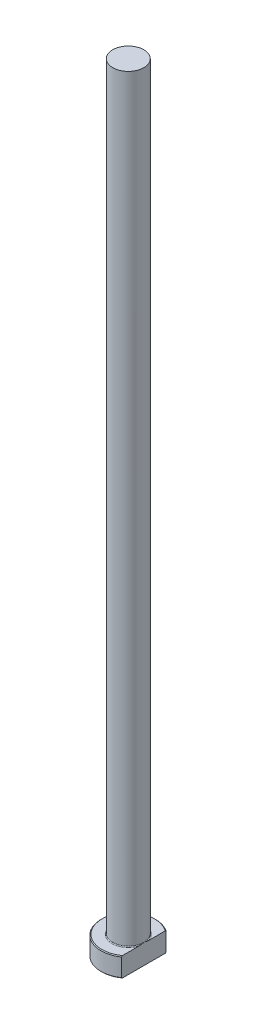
from build123d import *
from build123d.topology import SkipClean

# Parameters (mm, degrees)
CHAMFER1_SIZE = 0.2
FILLET1_R     = 0.2
KEY_DEPTH     = 201.244850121


with BuildPart() as part:
    # Sketch1 → Revolve1 (revolve)
    with BuildSketch(Plane.XY, mode=Mode.PRIVATE) as revolve1_sk:
        Polygon((0, 0), (-7, 0), (-7, 5), (-4, 5), (-4, 200), (0, 200), align=None)
    revolve(revolve1_sk.sketch.rotate(Axis((0, 259.958771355, 0), (0, -1, 0)), 270), axis=Axis((0, 259.958771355, 0), (0, -1, 0)))

    # Chamfer1
    chamfer1_edges = [part.edges().sort_by_distance(p)[0] for p in [
        (0, 5, -7),
        (0, 0, -7),
    ]]
    chamfer(chamfer1_edges, length=CHAMFER1_SIZE)

    # Fillet1
    fillet1_edges = [part.edges().sort_by_distance(p)[0] for p in [
        (0, 5, -4),
    ]]
    fillet(fillet1_edges, radius=FILLET1_R)

    # Sketch2 → KEY (cut, through all)
    with SkipClean():  # the faces are left unmerged after this step: merging them gives an invalid solid
        with BuildSketch(Plane(origin=(0, 0, 0), x_dir=(1, 0, 0), z_dir=(0, 1, 0))):
            with BuildLine():
                Line((4, 5.744562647), (4, -5.744562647))
                ThreePointArc((4, -5.744562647), (7, 0), (4, 5.744562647))
            make_face()
        extrude(amount=KEY_DEPTH, mode=Mode.SUBTRACT)


solid = part.part
